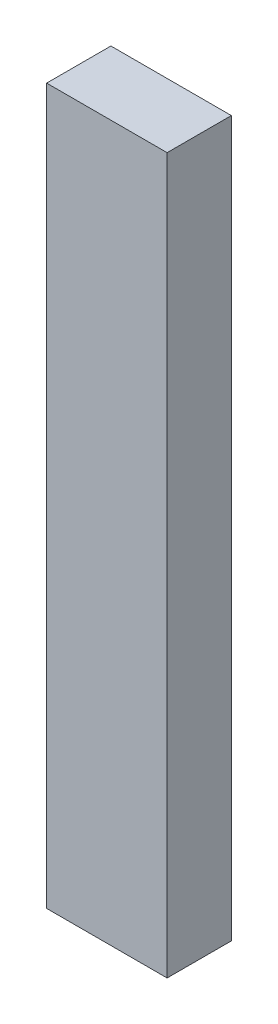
ISO-10303-21;
HEADER;
FILE_DESCRIPTION(('STEP AP214'),'2;1');
FILE_NAME('part.step','',(''),(''),'','','');
FILE_SCHEMA(('AUTOMOTIVE_DESIGN { 1 0 10303 214 1 1 1 1 }'));
ENDSEC;
DATA;
#1=APPLICATION_CONTEXT('core data for automotive mechanical design processes');
#2=APPLICATION_PROTOCOL_DEFINITION('international standard','automotive_design',2000,#1);
#3=PRODUCT_CONTEXT('',#1,'mechanical');
#4=PRODUCT('Part','Part','',(#3));
#5=PRODUCT_RELATED_PRODUCT_CATEGORY('part','',(#4));
#6=PRODUCT_DEFINITION_FORMATION('','',#4);
#7=PRODUCT_DEFINITION_CONTEXT('part definition',#1,'design');
#8=PRODUCT_DEFINITION('design','',#6,#7);
#9=PRODUCT_DEFINITION_SHAPE('','',#8);
#10=(LENGTH_UNIT() NAMED_UNIT(*) SI_UNIT(.MILLI.,.METRE.));
#11=(NAMED_UNIT(*) PLANE_ANGLE_UNIT() SI_UNIT($,.RADIAN.));
#12=(NAMED_UNIT(*) SI_UNIT($,.STERADIAN.) SOLID_ANGLE_UNIT());
#13=UNCERTAINTY_MEASURE_WITH_UNIT(LENGTH_MEASURE(1.E-05),#10,'distance_accuracy_value','');
#14=(GEOMETRIC_REPRESENTATION_CONTEXT(3) GLOBAL_UNCERTAINTY_ASSIGNED_CONTEXT((#13)) GLOBAL_UNIT_ASSIGNED_CONTEXT((#10,
#11,#12)) REPRESENTATION_CONTEXT('',''));
#15=CARTESIAN_POINT('',(0.,0.,0.));
#16=DIRECTION('',(0.,0.,1.));
#17=DIRECTION('',(1.,0.,0.));
#18=AXIS2_PLACEMENT_3D('',#15,#16,#17);
#19=CARTESIAN_POINT('',(0.,0.,8.));
#20=DIRECTION('',(1.,0.,0.));
#21=DIRECTION('',(0.,0.,-1.));
#22=AXIS2_PLACEMENT_3D('',#19,#20,#21);
#23=PLANE('',#22);
#24=DIRECTION('',(0.,-1.,0.));
#25=VECTOR('',#24,1.);
#26=CARTESIAN_POINT('',(0.,0.,0.));
#27=LINE('',#26,#25);
#28=CARTESIAN_POINT('',(0.,89.,0.));
#29=VERTEX_POINT('',#28);
#30=CARTESIAN_POINT('',(0.,0.,0.));
#31=VERTEX_POINT('',#30);
#32=EDGE_CURVE('E94',#29,#31,#27,.T.);
#33=ORIENTED_EDGE('',*,*,#32,.T.);
#34=DIRECTION('',(0.,0.,-1.));
#35=VECTOR('',#34,1.);
#36=CARTESIAN_POINT('',(0.,0.,8.));
#37=LINE('',#36,#35);
#38=CARTESIAN_POINT('',(0.,0.,8.));
#39=VERTEX_POINT('',#38);
#40=EDGE_CURVE('E11',#39,#31,#37,.T.);
#41=ORIENTED_EDGE('',*,*,#40,.F.);
#42=DIRECTION('',(0.,-1.,0.));
#43=VECTOR('',#42,1.);
#44=CARTESIAN_POINT('',(0.,0.,8.));
#45=LINE('',#44,#43);
#46=CARTESIAN_POINT('',(0.,89.,8.));
#47=VERTEX_POINT('',#46);
#48=EDGE_CURVE('E82',#47,#39,#45,.T.);
#49=ORIENTED_EDGE('',*,*,#48,.F.);
#50=DIRECTION('',(0.,0.,-1.));
#51=VECTOR('',#50,1.);
#52=CARTESIAN_POINT('',(0.,89.,8.));
#53=LINE('',#52,#51);
#54=EDGE_CURVE('E90',#47,#29,#53,.T.);
#55=ORIENTED_EDGE('',*,*,#54,.T.);
#56=EDGE_LOOP('',(#33,#41,#49,#55));
#57=FACE_BOUND('',#56,.T.);
#58=ADVANCED_FACE('F31',(#57),#23,.F.);
#59=CARTESIAN_POINT('',(0.,0.,8.));
#60=DIRECTION('',(0.,1.,0.));
#61=DIRECTION('',(0.,0.,1.));
#62=AXIS2_PLACEMENT_3D('',#59,#60,#61);
#63=PLANE('',#62);
#64=DIRECTION('',(1.,0.,0.));
#65=VECTOR('',#64,1.);
#66=CARTESIAN_POINT('',(0.,0.,0.));
#67=LINE('',#66,#65);
#68=CARTESIAN_POINT('',(15.,0.,0.));
#69=VERTEX_POINT('',#68);
#70=EDGE_CURVE('E86',#31,#69,#67,.T.);
#71=ORIENTED_EDGE('',*,*,#70,.T.);
#72=DIRECTION('',(0.,0.,-1.));
#73=VECTOR('',#72,1.);
#74=CARTESIAN_POINT('',(15.,0.,8.));
#75=LINE('',#74,#73);
#76=CARTESIAN_POINT('',(15.,0.,8.));
#77=VERTEX_POINT('',#76);
#78=EDGE_CURVE('E39',#77,#69,#75,.T.);
#79=ORIENTED_EDGE('',*,*,#78,.F.);
#80=DIRECTION('',(1.,0.,0.));
#81=VECTOR('',#80,1.);
#82=CARTESIAN_POINT('',(0.,0.,8.));
#83=LINE('',#82,#81);
#84=EDGE_CURVE('E77',#39,#77,#83,.T.);
#85=ORIENTED_EDGE('',*,*,#84,.F.);
#86=ORIENTED_EDGE('',*,*,#40,.T.);
#87=EDGE_LOOP('',(#71,#79,#85,#86));
#88=FACE_BOUND('',#87,.T.);
#89=ADVANCED_FACE('F85',(#88),#63,.F.);
#90=CARTESIAN_POINT('',(15.,0.,8.));
#91=DIRECTION('',(-1.,0.,0.));
#92=DIRECTION('',(0.,0.,1.));
#93=AXIS2_PLACEMENT_3D('',#90,#91,#92);
#94=PLANE('',#93);
#95=DIRECTION('',(0.,1.,0.));
#96=VECTOR('',#95,1.);
#97=CARTESIAN_POINT('',(15.,0.,0.));
#98=LINE('',#97,#96);
#99=CARTESIAN_POINT('',(15.,89.,0.));
#100=VERTEX_POINT('',#99);
#101=EDGE_CURVE('E64',#69,#100,#98,.T.);
#102=ORIENTED_EDGE('',*,*,#101,.T.);
#103=DIRECTION('',(0.,0.,-1.));
#104=VECTOR('',#103,1.);
#105=CARTESIAN_POINT('',(15.,89.,8.));
#106=LINE('',#105,#104);
#107=CARTESIAN_POINT('',(15.,89.,8.));
#108=VERTEX_POINT('',#107);
#109=EDGE_CURVE('E87',#108,#100,#106,.T.);
#110=ORIENTED_EDGE('',*,*,#109,.F.);
#111=DIRECTION('',(0.,1.,0.));
#112=VECTOR('',#111,1.);
#113=CARTESIAN_POINT('',(15.,0.,8.));
#114=LINE('',#113,#112);
#115=EDGE_CURVE('E80',#77,#108,#114,.T.);
#116=ORIENTED_EDGE('',*,*,#115,.F.);
#117=ORIENTED_EDGE('',*,*,#78,.T.);
#118=EDGE_LOOP('',(#102,#110,#116,#117));
#119=FACE_BOUND('',#118,.T.);
#120=ADVANCED_FACE('F88',(#119),#94,.F.);
#121=CARTESIAN_POINT('',(0.,89.,8.));
#122=DIRECTION('',(0.,-1.,0.));
#123=DIRECTION('',(0.,0.,-1.));
#124=AXIS2_PLACEMENT_3D('',#121,#122,#123);
#125=PLANE('',#124);
#126=DIRECTION('',(-1.,0.,0.));
#127=VECTOR('',#126,1.);
#128=CARTESIAN_POINT('',(0.,89.,0.));
#129=LINE('',#128,#127);
#130=EDGE_CURVE('E70',#100,#29,#129,.T.);
#131=ORIENTED_EDGE('',*,*,#130,.T.);
#132=ORIENTED_EDGE('',*,*,#54,.F.);
#133=DIRECTION('',(-1.,0.,0.));
#134=VECTOR('',#133,1.);
#135=CARTESIAN_POINT('',(0.,89.,8.));
#136=LINE('',#135,#134);
#137=EDGE_CURVE('E47',#108,#47,#136,.T.);
#138=ORIENTED_EDGE('',*,*,#137,.F.);
#139=ORIENTED_EDGE('',*,*,#109,.T.);
#140=EDGE_LOOP('',(#131,#132,#138,#139));
#141=FACE_BOUND('',#140,.T.);
#142=ADVANCED_FACE('F101',(#141),#125,.F.);
#143=CARTESIAN_POINT('',(0.,89.,8.));
#144=DIRECTION('',(0.,0.,-1.));
#145=DIRECTION('',(-1.,0.,0.));
#146=AXIS2_PLACEMENT_3D('',#143,#144,#145);
#147=PLANE('',#146);
#148=ORIENTED_EDGE('',*,*,#48,.T.);
#149=ORIENTED_EDGE('',*,*,#84,.T.);
#150=ORIENTED_EDGE('',*,*,#115,.T.);
#151=ORIENTED_EDGE('',*,*,#137,.T.);
#152=EDGE_LOOP('',(#148,#149,#150,#151));
#153=FACE_BOUND('',#152,.T.);
#154=ADVANCED_FACE('F78',(#153),#147,.F.);
#155=CARTESIAN_POINT('',(0.,89.,0.));
#156=DIRECTION('',(0.,0.,-1.));
#157=DIRECTION('',(-1.,0.,0.));
#158=AXIS2_PLACEMENT_3D('',#155,#156,#157);
#159=PLANE('',#158);
#160=ORIENTED_EDGE('',*,*,#32,.F.);
#161=ORIENTED_EDGE('',*,*,#130,.F.);
#162=ORIENTED_EDGE('',*,*,#101,.F.);
#163=ORIENTED_EDGE('',*,*,#70,.F.);
#164=EDGE_LOOP('',(#160,#161,#162,#163));
#165=FACE_BOUND('',#164,.T.);
#166=ADVANCED_FACE('F104',(#165),#159,.T.);
#167=CLOSED_SHELL('',(#58,#89,#120,#142,#154,#166));
#168=MANIFOLD_SOLID_BREP('B2',#167);
#169=ADVANCED_BREP_SHAPE_REPRESENTATION('',(#18,#168),#14);
#170=SHAPE_DEFINITION_REPRESENTATION(#9,#169);
ENDSEC;
END-ISO-10303-21;
